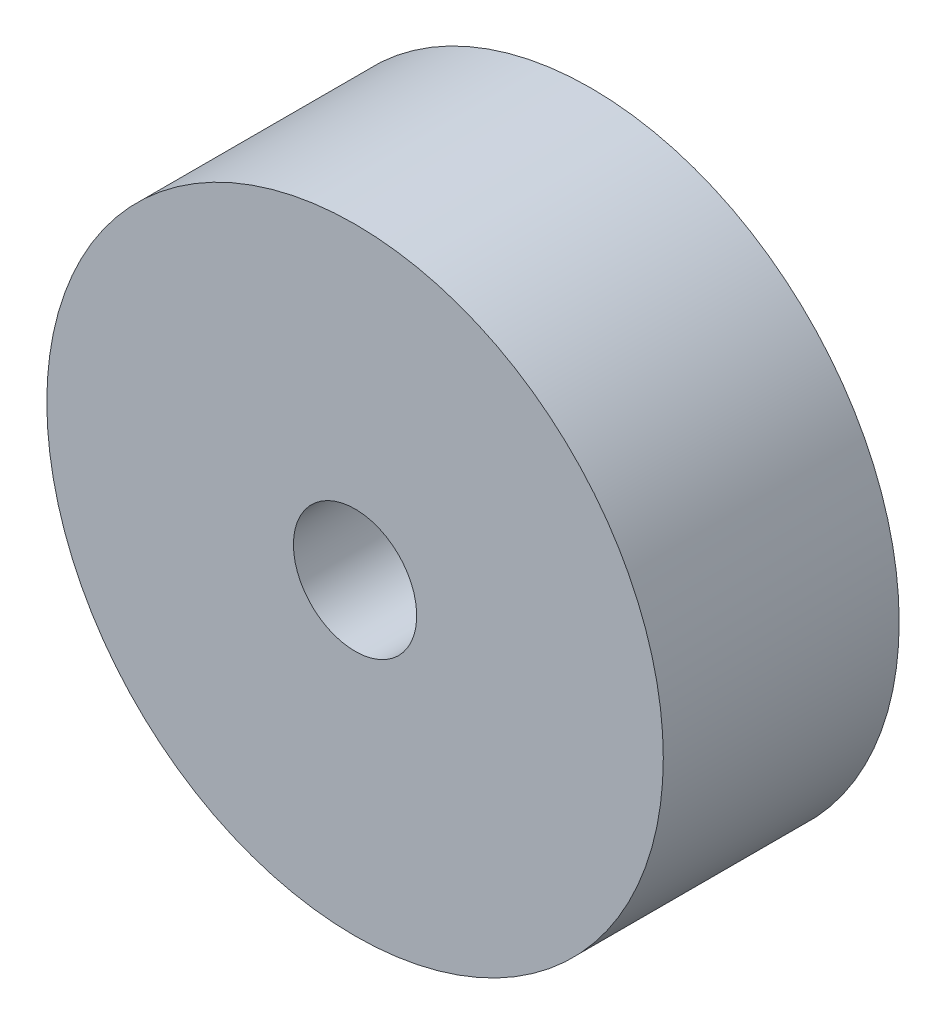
ISO-10303-21;
HEADER;
FILE_DESCRIPTION(('STEP AP214'),'2;1');
FILE_NAME('part.step','',(''),(''),'','','');
FILE_SCHEMA(('AUTOMOTIVE_DESIGN { 1 0 10303 214 1 1 1 1 }'));
ENDSEC;
DATA;
#1=APPLICATION_CONTEXT('core data for automotive mechanical design processes');
#2=APPLICATION_PROTOCOL_DEFINITION('international standard','automotive_design',2000,#1);
#3=PRODUCT_CONTEXT('',#1,'mechanical');
#4=PRODUCT('Part','Part','',(#3));
#5=PRODUCT_RELATED_PRODUCT_CATEGORY('part','',(#4));
#6=PRODUCT_DEFINITION_FORMATION('','',#4);
#7=PRODUCT_DEFINITION_CONTEXT('part definition',#1,'design');
#8=PRODUCT_DEFINITION('design','',#6,#7);
#9=PRODUCT_DEFINITION_SHAPE('','',#8);
#10=(LENGTH_UNIT() NAMED_UNIT(*) SI_UNIT(.MILLI.,.METRE.));
#11=(NAMED_UNIT(*) PLANE_ANGLE_UNIT() SI_UNIT($,.RADIAN.));
#12=(NAMED_UNIT(*) SI_UNIT($,.STERADIAN.) SOLID_ANGLE_UNIT());
#13=UNCERTAINTY_MEASURE_WITH_UNIT(LENGTH_MEASURE(1.E-05),#10,'distance_accuracy_value','');
#14=(GEOMETRIC_REPRESENTATION_CONTEXT(3) GLOBAL_UNCERTAINTY_ASSIGNED_CONTEXT((#13)) GLOBAL_UNIT_ASSIGNED_CONTEXT((#10,
#11,#12)) REPRESENTATION_CONTEXT('',''));
#15=CARTESIAN_POINT('',(0.,0.,0.));
#16=DIRECTION('',(0.,0.,1.));
#17=DIRECTION('',(1.,0.,0.));
#18=AXIS2_PLACEMENT_3D('',#15,#16,#17);
#19=CARTESIAN_POINT('',(0.,6.5,12.4347826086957));
#20=DIRECTION('',(0.,0.,1.));
#21=DIRECTION('',(1.,0.,0.));
#22=AXIS2_PLACEMENT_3D('',#19,#20,#21);
#23=PLANE('',#22);
#24=CARTESIAN_POINT('',(0.,0.,12.4347826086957));
#25=DIRECTION('',(0.,0.,-1.));
#26=DIRECTION('',(-1.,0.,0.));
#27=AXIS2_PLACEMENT_3D('',#24,#25,#26);
#28=CIRCLE('',#27,6.5);
#29=CARTESIAN_POINT('',(-6.5,0.,12.4347826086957));
#30=VERTEX_POINT('',#29);
#31=EDGE_CURVE('E10',#30,#30,#28,.T.);
#32=ORIENTED_EDGE('',*,*,#31,.T.);
#33=EDGE_LOOP('',(#32));
#34=FACE_BOUND('',#33,.T.);
#35=CARTESIAN_POINT('',(0.,0.,12.4347826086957));
#36=DIRECTION('',(0.,0.,-1.));
#37=DIRECTION('',(-1.,0.,0.));
#38=AXIS2_PLACEMENT_3D('',#35,#36,#37);
#39=CIRCLE('',#38,32.5);
#40=CARTESIAN_POINT('',(-32.5,0.,12.4347826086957));
#41=VERTEX_POINT('',#40);
#42=EDGE_CURVE('E56',#41,#41,#39,.T.);
#43=ORIENTED_EDGE('',*,*,#42,.F.);
#44=EDGE_LOOP('',(#43));
#45=FACE_BOUND('',#44,.T.);
#46=ADVANCED_FACE('F38',(#34,#45),#23,.T.);
#47=CARTESIAN_POINT('',(0.,0.,-88.99));
#48=DIRECTION('',(0.,0.,-1.));
#49=DIRECTION('',(-1.,0.,0.));
#50=AXIS2_PLACEMENT_3D('',#47,#48,#49);
#51=CYLINDRICAL_SURFACE('',#50,6.5);
#52=CARTESIAN_POINT('',(0.,0.,-12.4347826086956));
#53=DIRECTION('',(0.,0.,-1.));
#54=DIRECTION('',(-1.,0.,0.));
#55=AXIS2_PLACEMENT_3D('',#52,#53,#54);
#56=CIRCLE('',#55,6.5);
#57=CARTESIAN_POINT('',(-6.5,0.,-12.4347826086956));
#58=VERTEX_POINT('',#57);
#59=EDGE_CURVE('E46',#58,#58,#56,.T.);
#60=ORIENTED_EDGE('',*,*,#59,.T.);
#61=EDGE_LOOP('',(#60));
#62=FACE_BOUND('',#61,.T.);
#63=ORIENTED_EDGE('',*,*,#31,.F.);
#64=EDGE_LOOP('',(#63));
#65=FACE_BOUND('',#64,.T.);
#66=ADVANCED_FACE('F111',(#62,#65),#51,.F.);
#67=CARTESIAN_POINT('',(0.,6.5,-12.4347826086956));
#68=DIRECTION('',(0.,0.,-1.));
#69=DIRECTION('',(-1.,0.,0.));
#70=AXIS2_PLACEMENT_3D('',#67,#68,#69);
#71=PLANE('',#70);
#72=CARTESIAN_POINT('',(0.,0.,-12.4347826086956));
#73=DIRECTION('',(0.,0.,-1.));
#74=DIRECTION('',(-1.,0.,0.));
#75=AXIS2_PLACEMENT_3D('',#72,#73,#74);
#76=CIRCLE('',#75,32.5);
#77=CARTESIAN_POINT('',(-32.5,0.,-12.4347826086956));
#78=VERTEX_POINT('',#77);
#79=EDGE_CURVE('E51',#78,#78,#76,.T.);
#80=ORIENTED_EDGE('',*,*,#79,.T.);
#81=EDGE_LOOP('',(#80));
#82=FACE_BOUND('',#81,.T.);
#83=ORIENTED_EDGE('',*,*,#59,.F.);
#84=EDGE_LOOP('',(#83));
#85=FACE_BOUND('',#84,.T.);
#86=ADVANCED_FACE('F108',(#82,#85),#71,.T.);
#87=CARTESIAN_POINT('',(0.,0.,-88.99));
#88=DIRECTION('',(0.,0.,-1.));
#89=DIRECTION('',(-1.,0.,0.));
#90=AXIS2_PLACEMENT_3D('',#87,#88,#89);
#91=CYLINDRICAL_SURFACE('',#90,32.5);
#92=ORIENTED_EDGE('',*,*,#42,.T.);
#93=EDGE_LOOP('',(#92));
#94=FACE_BOUND('',#93,.T.);
#95=ORIENTED_EDGE('',*,*,#79,.F.);
#96=EDGE_LOOP('',(#95));
#97=FACE_BOUND('',#96,.T.);
#98=ADVANCED_FACE('F105',(#94,#97),#91,.T.);
#99=CLOSED_SHELL('',(#46,#66,#86,#98));
#100=CARTESIAN_POINT('',(0.,8.,11.));
#101=DIRECTION('',(0.,0.,1.));
#102=DIRECTION('',(1.,0.,0.));
#103=AXIS2_PLACEMENT_3D('',#100,#101,#102);
#104=PLANE('',#103);
#105=CARTESIAN_POINT('',(0.,0.,11.));
#106=DIRECTION('',(0.,0.,-1.));
#107=DIRECTION('',(-1.,0.,0.));
#108=AXIS2_PLACEMENT_3D('',#105,#106,#107);
#109=CIRCLE('',#108,8.);
#110=CARTESIAN_POINT('',(-8.,0.,11.));
#111=VERTEX_POINT('',#110);
#112=EDGE_CURVE('E74',#111,#111,#109,.T.);
#113=ORIENTED_EDGE('',*,*,#112,.F.);
#114=EDGE_LOOP('',(#113));
#115=FACE_BOUND('',#114,.T.);
#116=CARTESIAN_POINT('',(0.,0.,11.));
#117=DIRECTION('',(0.,0.,-1.));
#118=DIRECTION('',(-1.,0.,0.));
#119=AXIS2_PLACEMENT_3D('',#116,#117,#118);
#120=CIRCLE('',#119,31.);
#121=CARTESIAN_POINT('',(-31.,0.,11.));
#122=VERTEX_POINT('',#121);
#123=EDGE_CURVE('E62',#122,#122,#120,.T.);
#124=ORIENTED_EDGE('',*,*,#123,.T.);
#125=EDGE_LOOP('',(#124));
#126=FACE_BOUND('',#125,.T.);
#127=ADVANCED_FACE('F81',(#115,#126),#104,.F.);
#128=CARTESIAN_POINT('',(0.,0.,-88.99));
#129=DIRECTION('',(0.,0.,-1.));
#130=DIRECTION('',(-1.,0.,0.));
#131=AXIS2_PLACEMENT_3D('',#128,#129,#130);
#132=CYLINDRICAL_SURFACE('',#131,31.);
#133=ORIENTED_EDGE('',*,*,#123,.F.);
#134=EDGE_LOOP('',(#133));
#135=FACE_BOUND('',#134,.T.);
#136=CARTESIAN_POINT('',(0.,0.,-11.));
#137=DIRECTION('',(0.,0.,-1.));
#138=DIRECTION('',(-1.,0.,0.));
#139=AXIS2_PLACEMENT_3D('',#136,#137,#138);
#140=CIRCLE('',#139,31.);
#141=CARTESIAN_POINT('',(-31.,0.,-11.));
#142=VERTEX_POINT('',#141);
#143=EDGE_CURVE('E66',#142,#142,#140,.T.);
#144=ORIENTED_EDGE('',*,*,#143,.T.);
#145=EDGE_LOOP('',(#144));
#146=FACE_BOUND('',#145,.T.);
#147=ADVANCED_FACE('F84',(#135,#146),#132,.F.);
#148=CARTESIAN_POINT('',(0.,8.,-11.));
#149=DIRECTION('',(0.,0.,-1.));
#150=DIRECTION('',(-1.,0.,0.));
#151=AXIS2_PLACEMENT_3D('',#148,#149,#150);
#152=PLANE('',#151);
#153=ORIENTED_EDGE('',*,*,#143,.F.);
#154=EDGE_LOOP('',(#153));
#155=FACE_BOUND('',#154,.T.);
#156=CARTESIAN_POINT('',(0.,0.,-11.));
#157=DIRECTION('',(0.,0.,-1.));
#158=DIRECTION('',(-1.,0.,0.));
#159=AXIS2_PLACEMENT_3D('',#156,#157,#158);
#160=CIRCLE('',#159,8.);
#161=CARTESIAN_POINT('',(-8.,0.,-11.));
#162=VERTEX_POINT('',#161);
#163=EDGE_CURVE('E70',#162,#162,#160,.T.);
#164=ORIENTED_EDGE('',*,*,#163,.T.);
#165=EDGE_LOOP('',(#164));
#166=FACE_BOUND('',#165,.T.);
#167=ADVANCED_FACE('F91',(#155,#166),#152,.F.);
#168=CARTESIAN_POINT('',(0.,0.,-88.99));
#169=DIRECTION('',(0.,0.,-1.));
#170=DIRECTION('',(-1.,0.,0.));
#171=AXIS2_PLACEMENT_3D('',#168,#169,#170);
#172=CYLINDRICAL_SURFACE('',#171,8.);
#173=ORIENTED_EDGE('',*,*,#163,.F.);
#174=EDGE_LOOP('',(#173));
#175=FACE_BOUND('',#174,.T.);
#176=ORIENTED_EDGE('',*,*,#112,.T.);
#177=EDGE_LOOP('',(#176));
#178=FACE_BOUND('',#177,.T.);
#179=ADVANCED_FACE('F79',(#175,#178),#172,.T.);
#180=CLOSED_SHELL('',(#127,#147,#167,#179));
#181=ORIENTED_CLOSED_SHELL('',*,#180,.T.);
#182=BREP_WITH_VOIDS('B2',#99,(#181));
#183=ADVANCED_BREP_SHAPE_REPRESENTATION('',(#18,#182),#14);
#184=SHAPE_DEFINITION_REPRESENTATION(#9,#183);
ENDSEC;
END-ISO-10303-21;
